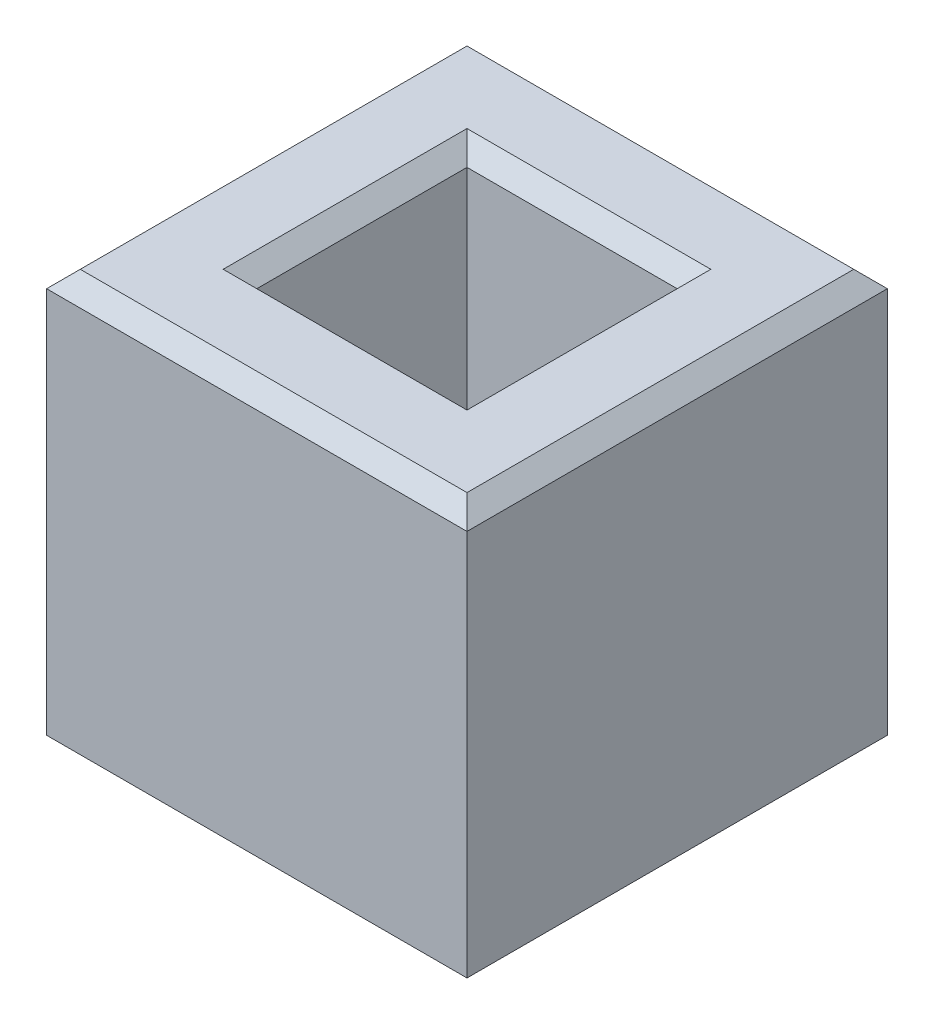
ISO-10303-21;
HEADER;
FILE_DESCRIPTION(('STEP AP214'),'2;1');
FILE_NAME('part.step','',(''),(''),'','','');
FILE_SCHEMA(('AUTOMOTIVE_DESIGN { 1 0 10303 214 1 1 1 1 }'));
ENDSEC;
DATA;
#1=APPLICATION_CONTEXT('core data for automotive mechanical design processes');
#2=APPLICATION_PROTOCOL_DEFINITION('international standard','automotive_design',2000,#1);
#3=PRODUCT_CONTEXT('',#1,'mechanical');
#4=PRODUCT('Part','Part','',(#3));
#5=PRODUCT_RELATED_PRODUCT_CATEGORY('part','',(#4));
#6=PRODUCT_DEFINITION_FORMATION('','',#4);
#7=PRODUCT_DEFINITION_CONTEXT('part definition',#1,'design');
#8=PRODUCT_DEFINITION('design','',#6,#7);
#9=PRODUCT_DEFINITION_SHAPE('','',#8);
#10=(LENGTH_UNIT() NAMED_UNIT(*) SI_UNIT(.MILLI.,.METRE.));
#11=(NAMED_UNIT(*) PLANE_ANGLE_UNIT() SI_UNIT($,.RADIAN.));
#12=(NAMED_UNIT(*) SI_UNIT($,.STERADIAN.) SOLID_ANGLE_UNIT());
#13=UNCERTAINTY_MEASURE_WITH_UNIT(LENGTH_MEASURE(1.E-05),#10,'distance_accuracy_value','');
#14=(GEOMETRIC_REPRESENTATION_CONTEXT(3) GLOBAL_UNCERTAINTY_ASSIGNED_CONTEXT((#13)) GLOBAL_UNIT_ASSIGNED_CONTEXT((#10,
#11,#12)) REPRESENTATION_CONTEXT('',''));
#15=CARTESIAN_POINT('',(0.,0.,0.));
#16=DIRECTION('',(0.,0.,1.));
#17=DIRECTION('',(1.,0.,0.));
#18=AXIS2_PLACEMENT_3D('',#15,#16,#17);
#19=CARTESIAN_POINT('',(63.5,127.,63.5));
#20=DIRECTION('',(-1.,0.,0.));
#21=DIRECTION('',(0.,0.,1.));
#22=AXIS2_PLACEMENT_3D('',#19,#20,#21);
#23=PLANE('',#22);
#24=DIRECTION('',(0.,-1.,0.));
#25=VECTOR('',#24,1.);
#26=CARTESIAN_POINT('',(63.5,127.,63.5));
#27=LINE('',#26,#25);
#28=CARTESIAN_POINT('',(63.5,121.92,63.5));
#29=VERTEX_POINT('',#28);
#30=CARTESIAN_POINT('',(63.5,5.08,63.5));
#31=VERTEX_POINT('',#30);
#32=EDGE_CURVE('E287',#29,#31,#27,.T.);
#33=ORIENTED_EDGE('',*,*,#32,.T.);
#34=DIRECTION('',(0.,0.,-1.));
#35=VECTOR('',#34,1.);
#36=CARTESIAN_POINT('',(63.5,5.08,-63.5));
#37=LINE('',#36,#35);
#38=CARTESIAN_POINT('',(63.5,5.08,-63.5));
#39=VERTEX_POINT('',#38);
#40=EDGE_CURVE('E258',#31,#39,#37,.T.);
#41=ORIENTED_EDGE('',*,*,#40,.T.);
#42=DIRECTION('',(0.,-1.,0.));
#43=VECTOR('',#42,1.);
#44=CARTESIAN_POINT('',(63.5,127.,-63.5));
#45=LINE('',#44,#43);
#46=CARTESIAN_POINT('',(63.5,121.92,-63.5));
#47=VERTEX_POINT('',#46);
#48=EDGE_CURVE('E168',#47,#39,#45,.T.);
#49=ORIENTED_EDGE('',*,*,#48,.F.);
#50=DIRECTION('',(0.,0.,1.));
#51=VECTOR('',#50,1.);
#52=CARTESIAN_POINT('',(63.5,121.92,63.5));
#53=LINE('',#52,#51);
#54=EDGE_CURVE('E260',#47,#29,#53,.T.);
#55=ORIENTED_EDGE('',*,*,#54,.T.);
#56=EDGE_LOOP('',(#33,#41,#49,#55));
#57=FACE_BOUND('',#56,.T.);
#58=ADVANCED_FACE('F33',(#57),#23,.F.);
#59=CARTESIAN_POINT('',(-63.5,127.,-63.5));
#60=DIRECTION('',(0.,0.,1.));
#61=DIRECTION('',(1.,0.,0.));
#62=AXIS2_PLACEMENT_3D('',#59,#60,#61);
#63=PLANE('',#62);
#64=ORIENTED_EDGE('',*,*,#48,.T.);
#65=DIRECTION('',(-1.,0.,0.));
#66=VECTOR('',#65,1.);
#67=CARTESIAN_POINT('',(-63.5,5.08,-63.5));
#68=LINE('',#67,#66);
#69=CARTESIAN_POINT('',(-63.5,5.08,-63.5));
#70=VERTEX_POINT('',#69);
#71=EDGE_CURVE('E167',#39,#70,#68,.T.);
#72=ORIENTED_EDGE('',*,*,#71,.T.);
#73=DIRECTION('',(0.,-1.,0.));
#74=VECTOR('',#73,1.);
#75=CARTESIAN_POINT('',(-63.5,127.,-63.5));
#76=LINE('',#75,#74);
#77=CARTESIAN_POINT('',(-63.5,121.92,-63.5));
#78=VERTEX_POINT('',#77);
#79=EDGE_CURVE('E150',#78,#70,#76,.T.);
#80=ORIENTED_EDGE('',*,*,#79,.F.);
#81=DIRECTION('',(1.,0.,0.));
#82=VECTOR('',#81,1.);
#83=CARTESIAN_POINT('',(-63.5,121.92,-63.5));
#84=LINE('',#83,#82);
#85=EDGE_CURVE('E164',#78,#47,#84,.T.);
#86=ORIENTED_EDGE('',*,*,#85,.T.);
#87=EDGE_LOOP('',(#64,#72,#80,#86));
#88=FACE_BOUND('',#87,.T.);
#89=ADVANCED_FACE('F163',(#88),#63,.F.);
#90=CARTESIAN_POINT('',(-63.5,127.,63.5));
#91=DIRECTION('',(1.,0.,0.));
#92=DIRECTION('',(0.,0.,-1.));
#93=AXIS2_PLACEMENT_3D('',#90,#91,#92);
#94=PLANE('',#93);
#95=ORIENTED_EDGE('',*,*,#79,.T.);
#96=DIRECTION('',(0.,0.,1.));
#97=VECTOR('',#96,1.);
#98=CARTESIAN_POINT('',(-63.5,5.08,63.5));
#99=LINE('',#98,#97);
#100=CARTESIAN_POINT('',(-63.5,5.08,63.5));
#101=VERTEX_POINT('',#100);
#102=EDGE_CURVE('E156',#70,#101,#99,.T.);
#103=ORIENTED_EDGE('',*,*,#102,.T.);
#104=DIRECTION('',(0.,-1.,0.));
#105=VECTOR('',#104,1.);
#106=CARTESIAN_POINT('',(-63.5,127.,63.5));
#107=LINE('',#106,#105);
#108=CARTESIAN_POINT('',(-63.5,121.92,63.5));
#109=VERTEX_POINT('',#108);
#110=EDGE_CURVE('E152',#109,#101,#107,.T.);
#111=ORIENTED_EDGE('',*,*,#110,.F.);
#112=DIRECTION('',(0.,0.,-1.));
#113=VECTOR('',#112,1.);
#114=CARTESIAN_POINT('',(-63.5,121.92,63.5));
#115=LINE('',#114,#113);
#116=EDGE_CURVE('E147',#109,#78,#115,.T.);
#117=ORIENTED_EDGE('',*,*,#116,.T.);
#118=EDGE_LOOP('',(#95,#103,#111,#117));
#119=FACE_BOUND('',#118,.T.);
#120=ADVANCED_FACE('F149',(#119),#94,.F.);
#121=CARTESIAN_POINT('',(-63.5,127.,63.5));
#122=DIRECTION('',(0.,0.,-1.));
#123=DIRECTION('',(-1.,0.,0.));
#124=AXIS2_PLACEMENT_3D('',#121,#122,#123);
#125=PLANE('',#124);
#126=ORIENTED_EDGE('',*,*,#110,.T.);
#127=DIRECTION('',(1.,0.,0.));
#128=VECTOR('',#127,1.);
#129=CARTESIAN_POINT('',(63.5,5.08,63.5));
#130=LINE('',#129,#128);
#131=EDGE_CURVE('E262',#101,#31,#130,.T.);
#132=ORIENTED_EDGE('',*,*,#131,.T.);
#133=ORIENTED_EDGE('',*,*,#32,.F.);
#134=DIRECTION('',(-1.,0.,0.));
#135=VECTOR('',#134,1.);
#136=CARTESIAN_POINT('',(-63.5,121.92,63.5));
#137=LINE('',#136,#135);
#138=EDGE_CURVE('E264',#29,#109,#137,.T.);
#139=ORIENTED_EDGE('',*,*,#138,.T.);
#140=EDGE_LOOP('',(#126,#132,#133,#139));
#141=FACE_BOUND('',#140,.T.);
#142=ADVANCED_FACE('F527',(#141),#125,.F.);
#143=CARTESIAN_POINT('',(0.,127.,0.));
#144=DIRECTION('',(0.,-1.,0.));
#145=DIRECTION('',(0.,0.,-1.));
#146=AXIS2_PLACEMENT_3D('',#143,#144,#145);
#147=PLANE('',#146);
#148=DIRECTION('',(0.,0.,1.));
#149=VECTOR('',#148,1.);
#150=CARTESIAN_POINT('',(-58.42,127.,0.));
#151=LINE('',#150,#149);
#152=CARTESIAN_POINT('',(-58.42,127.,-58.42));
#153=VERTEX_POINT('',#152);
#154=CARTESIAN_POINT('',(-58.42,127.,58.42));
#155=VERTEX_POINT('',#154);
#156=EDGE_CURVE('E42',#153,#155,#151,.T.);
#157=ORIENTED_EDGE('',*,*,#156,.T.);
#158=DIRECTION('',(1.,0.,0.));
#159=VECTOR('',#158,1.);
#160=CARTESIAN_POINT('',(0.,127.,58.42));
#161=LINE('',#160,#159);
#162=CARTESIAN_POINT('',(58.42,127.,58.42));
#163=VERTEX_POINT('',#162);
#164=EDGE_CURVE('E11',#155,#163,#161,.T.);
#165=ORIENTED_EDGE('',*,*,#164,.T.);
#166=DIRECTION('',(0.,0.,-1.));
#167=VECTOR('',#166,1.);
#168=CARTESIAN_POINT('',(58.42,127.,0.));
#169=LINE('',#168,#167);
#170=CARTESIAN_POINT('',(58.42,127.,-58.42));
#171=VERTEX_POINT('',#170);
#172=EDGE_CURVE('E229',#163,#171,#169,.T.);
#173=ORIENTED_EDGE('',*,*,#172,.T.);
#174=DIRECTION('',(-1.,0.,0.));
#175=VECTOR('',#174,1.);
#176=CARTESIAN_POINT('',(0.,127.,-58.42));
#177=LINE('',#176,#175);
#178=EDGE_CURVE('E53',#171,#153,#177,.T.);
#179=ORIENTED_EDGE('',*,*,#178,.T.);
#180=EDGE_LOOP('',(#157,#165,#173,#179));
#181=FACE_BOUND('',#180,.T.);
#182=DIRECTION('',(-1.,0.,0.));
#183=VECTOR('',#182,1.);
#184=CARTESIAN_POINT('',(0.,127.,36.83));
#185=LINE('',#184,#183);
#186=CARTESIAN_POINT('',(36.83,127.,36.83));
#187=VERTEX_POINT('',#186);
#188=CARTESIAN_POINT('',(-36.83,127.,36.83));
#189=VERTEX_POINT('',#188);
#190=EDGE_CURVE('E234',#187,#189,#185,.T.);
#191=ORIENTED_EDGE('',*,*,#190,.T.);
#192=DIRECTION('',(0.,0.,-1.));
#193=VECTOR('',#192,1.);
#194=CARTESIAN_POINT('',(-36.83,127.,0.));
#195=LINE('',#194,#193);
#196=CARTESIAN_POINT('',(-36.83,127.,-36.83));
#197=VERTEX_POINT('',#196);
#198=EDGE_CURVE('E231',#189,#197,#195,.T.);
#199=ORIENTED_EDGE('',*,*,#198,.T.);
#200=DIRECTION('',(1.,0.,0.));
#201=VECTOR('',#200,1.);
#202=CARTESIAN_POINT('',(0.,127.,-36.83));
#203=LINE('',#202,#201);
#204=CARTESIAN_POINT('',(36.83,127.,-36.83));
#205=VERTEX_POINT('',#204);
#206=EDGE_CURVE('E238',#197,#205,#203,.T.);
#207=ORIENTED_EDGE('',*,*,#206,.T.);
#208=DIRECTION('',(0.,0.,1.));
#209=VECTOR('',#208,1.);
#210=CARTESIAN_POINT('',(36.83,127.,0.));
#211=LINE('',#210,#209);
#212=EDGE_CURVE('E236',#205,#187,#211,.T.);
#213=ORIENTED_EDGE('',*,*,#212,.T.);
#214=EDGE_LOOP('',(#191,#199,#207,#213));
#215=FACE_BOUND('',#214,.T.);
#216=ADVANCED_FACE('F518',(#181,#215),#147,.F.);
#217=CARTESIAN_POINT('',(0.,0.,0.));
#218=DIRECTION('',(0.,-1.,0.));
#219=DIRECTION('',(0.,0.,-1.));
#220=AXIS2_PLACEMENT_3D('',#217,#218,#219);
#221=PLANE('',#220);
#222=DIRECTION('',(0.,0.,-1.));
#223=VECTOR('',#222,1.);
#224=CARTESIAN_POINT('',(-58.42,0.,-63.5));
#225=LINE('',#224,#223);
#226=CARTESIAN_POINT('',(-58.42,0.,58.42));
#227=VERTEX_POINT('',#226);
#228=CARTESIAN_POINT('',(-58.42,0.,-58.42));
#229=VERTEX_POINT('',#228);
#230=EDGE_CURVE('E269',#227,#229,#225,.T.);
#231=ORIENTED_EDGE('',*,*,#230,.T.);
#232=DIRECTION('',(1.,0.,0.));
#233=VECTOR('',#232,1.);
#234=CARTESIAN_POINT('',(63.5,0.,-58.42));
#235=LINE('',#234,#233);
#236=CARTESIAN_POINT('',(58.42,0.,-58.42));
#237=VERTEX_POINT('',#236);
#238=EDGE_CURVE('E157',#229,#237,#235,.T.);
#239=ORIENTED_EDGE('',*,*,#238,.T.);
#240=DIRECTION('',(0.,0.,1.));
#241=VECTOR('',#240,1.);
#242=CARTESIAN_POINT('',(58.42,0.,63.5));
#243=LINE('',#242,#241);
#244=CARTESIAN_POINT('',(58.42,0.,58.42));
#245=VERTEX_POINT('',#244);
#246=EDGE_CURVE('E273',#237,#245,#243,.T.);
#247=ORIENTED_EDGE('',*,*,#246,.T.);
#248=DIRECTION('',(-1.,0.,0.));
#249=VECTOR('',#248,1.);
#250=CARTESIAN_POINT('',(-63.5,0.,58.42));
#251=LINE('',#250,#249);
#252=EDGE_CURVE('E271',#245,#227,#251,.T.);
#253=ORIENTED_EDGE('',*,*,#252,.T.);
#254=EDGE_LOOP('',(#231,#239,#247,#253));
#255=FACE_BOUND('',#254,.T.);
#256=DIRECTION('',(0.,0.,1.));
#257=VECTOR('',#256,1.);
#258=CARTESIAN_POINT('',(-36.83,0.,31.75));
#259=LINE('',#258,#257);
#260=CARTESIAN_POINT('',(-36.83,0.,-36.83));
#261=VERTEX_POINT('',#260);
#262=CARTESIAN_POINT('',(-36.83,0.,36.83));
#263=VERTEX_POINT('',#262);
#264=EDGE_CURVE('E278',#261,#263,#259,.T.);
#265=ORIENTED_EDGE('',*,*,#264,.T.);
#266=DIRECTION('',(1.,0.,0.));
#267=VECTOR('',#266,1.);
#268=CARTESIAN_POINT('',(31.75,0.,36.83));
#269=LINE('',#268,#267);
#270=CARTESIAN_POINT('',(36.83,0.,36.83));
#271=VERTEX_POINT('',#270);
#272=EDGE_CURVE('E275',#263,#271,#269,.T.);
#273=ORIENTED_EDGE('',*,*,#272,.T.);
#274=DIRECTION('',(0.,0.,-1.));
#275=VECTOR('',#274,1.);
#276=CARTESIAN_POINT('',(36.83,0.,-31.75));
#277=LINE('',#276,#275);
#278=CARTESIAN_POINT('',(36.83,0.,-36.83));
#279=VERTEX_POINT('',#278);
#280=EDGE_CURVE('E282',#271,#279,#277,.T.);
#281=ORIENTED_EDGE('',*,*,#280,.T.);
#282=DIRECTION('',(-1.,0.,0.));
#283=VECTOR('',#282,1.);
#284=CARTESIAN_POINT('',(-31.75,0.,-36.83));
#285=LINE('',#284,#283);
#286=EDGE_CURVE('E280',#279,#261,#285,.T.);
#287=ORIENTED_EDGE('',*,*,#286,.T.);
#288=EDGE_LOOP('',(#265,#273,#281,#287));
#289=FACE_BOUND('',#288,.T.);
#290=ADVANCED_FACE('F337',(#255,#289),#221,.T.);
#291=CARTESIAN_POINT('',(31.75,0.,31.75));
#292=DIRECTION('',(1.,0.,0.));
#293=DIRECTION('',(0.,0.,-1.));
#294=AXIS2_PLACEMENT_3D('',#291,#292,#293);
#295=PLANE('',#294);
#296=DIRECTION('',(0.,1.,0.));
#297=VECTOR('',#296,1.);
#298=CARTESIAN_POINT('',(31.75,0.,-31.75));
#299=LINE('',#298,#297);
#300=CARTESIAN_POINT('',(31.75,5.08000000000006,-31.75));
#301=VERTEX_POINT('',#300);
#302=CARTESIAN_POINT('',(31.75,121.92,-31.75));
#303=VERTEX_POINT('',#302);
#304=EDGE_CURVE('E220',#301,#303,#299,.T.);
#305=ORIENTED_EDGE('',*,*,#304,.F.);
#306=DIRECTION('',(0.,0.,1.));
#307=VECTOR('',#306,1.);
#308=CARTESIAN_POINT('',(31.75,5.08000000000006,31.75));
#309=LINE('',#308,#307);
#310=CARTESIAN_POINT('',(31.75,5.08000000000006,31.75));
#311=VERTEX_POINT('',#310);
#312=EDGE_CURVE('E240',#301,#311,#309,.T.);
#313=ORIENTED_EDGE('',*,*,#312,.T.);
#314=DIRECTION('',(0.,1.,0.));
#315=VECTOR('',#314,1.);
#316=CARTESIAN_POINT('',(31.75,0.,31.75));
#317=LINE('',#316,#315);
#318=CARTESIAN_POINT('',(31.75,121.92,31.75));
#319=VERTEX_POINT('',#318);
#320=EDGE_CURVE('E290',#311,#319,#317,.T.);
#321=ORIENTED_EDGE('',*,*,#320,.T.);
#322=DIRECTION('',(0.,0.,-1.));
#323=VECTOR('',#322,1.);
#324=CARTESIAN_POINT('',(31.75,121.92,31.75));
#325=LINE('',#324,#323);
#326=EDGE_CURVE('E242',#319,#303,#325,.T.);
#327=ORIENTED_EDGE('',*,*,#326,.T.);
#328=EDGE_LOOP('',(#305,#313,#321,#327));
#329=FACE_BOUND('',#328,.T.);
#330=ADVANCED_FACE('F304',(#329),#295,.F.);
#331=CARTESIAN_POINT('',(-31.75,0.,31.75));
#332=DIRECTION('',(0.,0.,1.));
#333=DIRECTION('',(1.,0.,0.));
#334=AXIS2_PLACEMENT_3D('',#331,#332,#333);
#335=PLANE('',#334);
#336=ORIENTED_EDGE('',*,*,#320,.F.);
#337=DIRECTION('',(-1.,0.,0.));
#338=VECTOR('',#337,1.);
#339=CARTESIAN_POINT('',(-31.75,5.08000000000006,31.75));
#340=LINE('',#339,#338);
#341=CARTESIAN_POINT('',(-31.75,5.08000000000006,31.75));
#342=VERTEX_POINT('',#341);
#343=EDGE_CURVE('E253',#311,#342,#340,.T.);
#344=ORIENTED_EDGE('',*,*,#343,.T.);
#345=DIRECTION('',(0.,1.,0.));
#346=VECTOR('',#345,1.);
#347=CARTESIAN_POINT('',(-31.75,0.,31.75));
#348=LINE('',#347,#346);
#349=CARTESIAN_POINT('',(-31.75,121.92,31.75));
#350=VERTEX_POINT('',#349);
#351=EDGE_CURVE('E296',#342,#350,#348,.T.);
#352=ORIENTED_EDGE('',*,*,#351,.T.);
#353=DIRECTION('',(1.,0.,0.));
#354=VECTOR('',#353,1.);
#355=CARTESIAN_POINT('',(-31.75,121.92,31.75));
#356=LINE('',#355,#354);
#357=EDGE_CURVE('E256',#350,#319,#356,.T.);
#358=ORIENTED_EDGE('',*,*,#357,.T.);
#359=EDGE_LOOP('',(#336,#344,#352,#358));
#360=FACE_BOUND('',#359,.T.);
#361=ADVANCED_FACE('F327',(#360),#335,.F.);
#362=CARTESIAN_POINT('',(-31.75,0.,31.75));
#363=DIRECTION('',(-1.,0.,0.));
#364=DIRECTION('',(0.,0.,1.));
#365=AXIS2_PLACEMENT_3D('',#362,#363,#364);
#366=PLANE('',#365);
#367=ORIENTED_EDGE('',*,*,#351,.F.);
#368=DIRECTION('',(0.,0.,-1.));
#369=VECTOR('',#368,1.);
#370=CARTESIAN_POINT('',(-31.75,5.08000000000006,-31.75));
#371=LINE('',#370,#369);
#372=CARTESIAN_POINT('',(-31.75,5.08000000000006,-31.75));
#373=VERTEX_POINT('',#372);
#374=EDGE_CURVE('E248',#342,#373,#371,.T.);
#375=ORIENTED_EDGE('',*,*,#374,.T.);
#376=DIRECTION('',(0.,1.,0.));
#377=VECTOR('',#376,1.);
#378=CARTESIAN_POINT('',(-31.75,0.,-31.75));
#379=LINE('',#378,#377);
#380=CARTESIAN_POINT('',(-31.75,121.92,-31.75));
#381=VERTEX_POINT('',#380);
#382=EDGE_CURVE('E293',#373,#381,#379,.T.);
#383=ORIENTED_EDGE('',*,*,#382,.T.);
#384=DIRECTION('',(0.,0.,1.));
#385=VECTOR('',#384,1.);
#386=CARTESIAN_POINT('',(-31.75,121.92,31.75));
#387=LINE('',#386,#385);
#388=EDGE_CURVE('E250',#381,#350,#387,.T.);
#389=ORIENTED_EDGE('',*,*,#388,.T.);
#390=EDGE_LOOP('',(#367,#375,#383,#389));
#391=FACE_BOUND('',#390,.T.);
#392=ADVANCED_FACE('F319',(#391),#366,.F.);
#393=CARTESIAN_POINT('',(-31.75,0.,-31.75));
#394=DIRECTION('',(0.,0.,-1.));
#395=DIRECTION('',(-1.,0.,0.));
#396=AXIS2_PLACEMENT_3D('',#393,#394,#395);
#397=PLANE('',#396);
#398=ORIENTED_EDGE('',*,*,#382,.F.);
#399=DIRECTION('',(1.,0.,0.));
#400=VECTOR('',#399,1.);
#401=CARTESIAN_POINT('',(31.75,5.08000000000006,-31.75));
#402=LINE('',#401,#400);
#403=EDGE_CURVE('E244',#373,#301,#402,.T.);
#404=ORIENTED_EDGE('',*,*,#403,.T.);
#405=ORIENTED_EDGE('',*,*,#304,.T.);
#406=DIRECTION('',(-1.,0.,0.));
#407=VECTOR('',#406,1.);
#408=CARTESIAN_POINT('',(-31.75,121.92,-31.75));
#409=LINE('',#408,#407);
#410=EDGE_CURVE('E246',#303,#381,#409,.T.);
#411=ORIENTED_EDGE('',*,*,#410,.T.);
#412=EDGE_LOOP('',(#398,#404,#405,#411));
#413=FACE_BOUND('',#412,.T.);
#414=ADVANCED_FACE('F315',(#413),#397,.F.);
#415=CARTESIAN_POINT('',(-63.5,5.08,63.5));
#416=DIRECTION('',(0.,-0.70710678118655,0.707106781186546));
#417=DIRECTION('',(-1.,0.,0.));
#418=AXIS2_PLACEMENT_3D('',#415,#416,#417);
#419=PLANE('',#418);
#420=DIRECTION('',(0.577350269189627,-0.577350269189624,-0.577350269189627));
#421=VECTOR('',#420,1.);
#422=CARTESIAN_POINT('',(-63.5,5.08,63.5));
#423=LINE('',#422,#421);
#424=EDGE_CURVE('E221',#227,#101,#423,.F.);
#425=ORIENTED_EDGE('',*,*,#424,.F.);
#426=ORIENTED_EDGE('',*,*,#252,.F.);
#427=DIRECTION('',(-0.577350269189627,-0.577350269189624,-0.577350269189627));
#428=VECTOR('',#427,1.);
#429=CARTESIAN_POINT('',(63.5,5.08,63.5));
#430=LINE('',#429,#428);
#431=EDGE_CURVE('E217',#31,#245,#430,.T.);
#432=ORIENTED_EDGE('',*,*,#431,.F.);
#433=ORIENTED_EDGE('',*,*,#131,.F.);
#434=EDGE_LOOP('',(#425,#426,#432,#433));
#435=FACE_BOUND('',#434,.T.);
#436=ADVANCED_FACE('F367',(#435),#419,.T.);
#437=CARTESIAN_POINT('',(63.5,5.08,63.5));
#438=DIRECTION('',(0.707106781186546,-0.70710678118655,0.));
#439=DIRECTION('',(0.,0.,1.));
#440=AXIS2_PLACEMENT_3D('',#437,#438,#439);
#441=PLANE('',#440);
#442=ORIENTED_EDGE('',*,*,#431,.T.);
#443=ORIENTED_EDGE('',*,*,#246,.F.);
#444=DIRECTION('',(0.577350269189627,0.577350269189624,-0.577350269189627));
#445=VECTOR('',#444,1.);
#446=CARTESIAN_POINT('',(21.1666666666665,-37.2533333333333,-21.1666666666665));
#447=LINE('',#446,#445);
#448=EDGE_CURVE('E224',#39,#237,#447,.F.);
#449=ORIENTED_EDGE('',*,*,#448,.F.);
#450=ORIENTED_EDGE('',*,*,#40,.F.);
#451=EDGE_LOOP('',(#442,#443,#449,#450));
#452=FACE_BOUND('',#451,.T.);
#453=ADVANCED_FACE('F363',(#452),#441,.T.);
#454=CARTESIAN_POINT('',(-63.5,5.08,63.5));
#455=DIRECTION('',(-0.707106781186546,-0.70710678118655,0.));
#456=DIRECTION('',(0.,0.,-1.));
#457=AXIS2_PLACEMENT_3D('',#454,#455,#456);
#458=PLANE('',#457);
#459=ORIENTED_EDGE('',*,*,#424,.T.);
#460=ORIENTED_EDGE('',*,*,#102,.F.);
#461=DIRECTION('',(0.577350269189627,-0.577350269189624,0.577350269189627));
#462=VECTOR('',#461,1.);
#463=CARTESIAN_POINT('',(-21.1666666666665,-37.2533333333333,-21.1666666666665));
#464=LINE('',#463,#462);
#465=EDGE_CURVE('E212',#229,#70,#464,.F.);
#466=ORIENTED_EDGE('',*,*,#465,.F.);
#467=ORIENTED_EDGE('',*,*,#230,.F.);
#468=EDGE_LOOP('',(#459,#460,#466,#467));
#469=FACE_BOUND('',#468,.T.);
#470=ADVANCED_FACE('F348',(#469),#458,.T.);
#471=CARTESIAN_POINT('',(-63.5,5.08,-63.5));
#472=DIRECTION('',(0.,-0.70710678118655,-0.707106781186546));
#473=DIRECTION('',(1.,0.,0.));
#474=AXIS2_PLACEMENT_3D('',#471,#472,#473);
#475=PLANE('',#474);
#476=ORIENTED_EDGE('',*,*,#448,.T.);
#477=ORIENTED_EDGE('',*,*,#238,.F.);
#478=ORIENTED_EDGE('',*,*,#465,.T.);
#479=ORIENTED_EDGE('',*,*,#71,.F.);
#480=EDGE_LOOP('',(#476,#477,#478,#479));
#481=FACE_BOUND('',#480,.T.);
#482=ADVANCED_FACE('F341',(#481),#475,.T.);
#483=CARTESIAN_POINT('',(0.,0.,-36.83));
#484=DIRECTION('',(0.,-0.707106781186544,0.707106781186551));
#485=DIRECTION('',(1.,0.,0.));
#486=AXIS2_PLACEMENT_3D('',#483,#484,#485);
#487=PLANE('',#486);
#488=DIRECTION('',(0.577350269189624,-0.57735026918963,-0.577350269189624));
#489=VECTOR('',#488,1.);
#490=CARTESIAN_POINT('',(24.5533333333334,12.2766666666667,-24.5533333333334));
#491=LINE('',#490,#489);
#492=EDGE_CURVE('E213',#301,#279,#491,.T.);
#493=ORIENTED_EDGE('',*,*,#492,.F.);
#494=ORIENTED_EDGE('',*,*,#403,.F.);
#495=DIRECTION('',(-0.577350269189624,-0.57735026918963,-0.577350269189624));
#496=VECTOR('',#495,1.);
#497=CARTESIAN_POINT('',(-24.5533333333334,12.2766666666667,-24.5533333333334));
#498=LINE('',#497,#496);
#499=EDGE_CURVE('E209',#261,#373,#498,.F.);
#500=ORIENTED_EDGE('',*,*,#499,.F.);
#501=ORIENTED_EDGE('',*,*,#286,.F.);
#502=EDGE_LOOP('',(#493,#494,#500,#501));
#503=FACE_BOUND('',#502,.T.);
#504=ADVANCED_FACE('F339',(#503),#487,.T.);
#505=CARTESIAN_POINT('',(-36.83,0.,0.));
#506=DIRECTION('',(0.707106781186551,-0.707106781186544,0.));
#507=DIRECTION('',(0.,0.,-1.));
#508=AXIS2_PLACEMENT_3D('',#505,#506,#507);
#509=PLANE('',#508);
#510=ORIENTED_EDGE('',*,*,#499,.T.);
#511=ORIENTED_EDGE('',*,*,#374,.F.);
#512=DIRECTION('',(-0.577350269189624,-0.57735026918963,0.577350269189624));
#513=VECTOR('',#512,1.);
#514=CARTESIAN_POINT('',(-24.5533333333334,12.2766666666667,24.5533333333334));
#515=LINE('',#514,#513);
#516=EDGE_CURVE('E181',#263,#342,#515,.F.);
#517=ORIENTED_EDGE('',*,*,#516,.F.);
#518=ORIENTED_EDGE('',*,*,#264,.F.);
#519=EDGE_LOOP('',(#510,#511,#517,#518));
#520=FACE_BOUND('',#519,.T.);
#521=ADVANCED_FACE('F323',(#520),#509,.T.);
#522=CARTESIAN_POINT('',(36.83,0.,0.));
#523=DIRECTION('',(-0.707106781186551,-0.707106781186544,0.));
#524=DIRECTION('',(0.,0.,1.));
#525=AXIS2_PLACEMENT_3D('',#522,#523,#524);
#526=PLANE('',#525);
#527=ORIENTED_EDGE('',*,*,#492,.T.);
#528=ORIENTED_EDGE('',*,*,#280,.F.);
#529=DIRECTION('',(-0.577350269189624,0.57735026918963,-0.577350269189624));
#530=VECTOR('',#529,1.);
#531=CARTESIAN_POINT('',(24.5533333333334,12.2766666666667,24.5533333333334));
#532=LINE('',#531,#530);
#533=EDGE_CURVE('E179',#311,#271,#532,.F.);
#534=ORIENTED_EDGE('',*,*,#533,.F.);
#535=ORIENTED_EDGE('',*,*,#312,.F.);
#536=EDGE_LOOP('',(#527,#528,#534,#535));
#537=FACE_BOUND('',#536,.T.);
#538=ADVANCED_FACE('F333',(#537),#526,.T.);
#539=CARTESIAN_POINT('',(0.,0.,36.83));
#540=DIRECTION('',(0.,-0.707106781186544,-0.707106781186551));
#541=DIRECTION('',(-1.,0.,0.));
#542=AXIS2_PLACEMENT_3D('',#539,#540,#541);
#543=PLANE('',#542);
#544=ORIENTED_EDGE('',*,*,#516,.T.);
#545=ORIENTED_EDGE('',*,*,#343,.F.);
#546=ORIENTED_EDGE('',*,*,#533,.T.);
#547=ORIENTED_EDGE('',*,*,#272,.F.);
#548=EDGE_LOOP('',(#544,#545,#546,#547));
#549=FACE_BOUND('',#548,.T.);
#550=ADVANCED_FACE('F330',(#549),#543,.T.);
#551=CARTESIAN_POINT('',(0.,127.,-58.42));
#552=DIRECTION('',(0.,-0.707106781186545,0.707106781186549));
#553=DIRECTION('',(-1.,0.,0.));
#554=AXIS2_PLACEMENT_3D('',#551,#552,#553);
#555=PLANE('',#554);
#556=DIRECTION('',(-0.577350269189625,0.577350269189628,0.577350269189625));
#557=VECTOR('',#556,1.);
#558=CARTESIAN_POINT('',(38.9466666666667,146.473333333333,-38.9466666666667));
#559=LINE('',#558,#557);
#560=EDGE_CURVE('E175',#47,#171,#559,.T.);
#561=ORIENTED_EDGE('',*,*,#560,.F.);
#562=ORIENTED_EDGE('',*,*,#85,.F.);
#563=DIRECTION('',(0.577350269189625,0.577350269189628,0.577350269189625));
#564=VECTOR('',#563,1.);
#565=CARTESIAN_POINT('',(-38.9466666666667,146.473333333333,-38.9466666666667));
#566=LINE('',#565,#564);
#567=EDGE_CURVE('E173',#153,#78,#566,.F.);
#568=ORIENTED_EDGE('',*,*,#567,.F.);
#569=ORIENTED_EDGE('',*,*,#178,.F.);
#570=EDGE_LOOP('',(#561,#562,#568,#569));
#571=FACE_BOUND('',#570,.T.);
#572=ADVANCED_FACE('F172',(#571),#555,.F.);
#573=CARTESIAN_POINT('',(-58.42,127.,0.));
#574=DIRECTION('',(0.707106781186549,-0.707106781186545,0.));
#575=DIRECTION('',(0.,0.,1.));
#576=AXIS2_PLACEMENT_3D('',#573,#574,#575);
#577=PLANE('',#576);
#578=ORIENTED_EDGE('',*,*,#567,.T.);
#579=ORIENTED_EDGE('',*,*,#116,.F.);
#580=DIRECTION('',(0.577350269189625,0.577350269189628,-0.577350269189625));
#581=VECTOR('',#580,1.);
#582=CARTESIAN_POINT('',(-38.9466666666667,146.473333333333,38.9466666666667));
#583=LINE('',#582,#581);
#584=EDGE_CURVE('E183',#155,#109,#583,.F.);
#585=ORIENTED_EDGE('',*,*,#584,.F.);
#586=ORIENTED_EDGE('',*,*,#156,.F.);
#587=EDGE_LOOP('',(#578,#579,#585,#586));
#588=FACE_BOUND('',#587,.T.);
#589=ADVANCED_FACE('F178',(#588),#577,.F.);
#590=CARTESIAN_POINT('',(58.42,127.,0.));
#591=DIRECTION('',(-0.707106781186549,-0.707106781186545,0.));
#592=DIRECTION('',(0.,0.,-1.));
#593=AXIS2_PLACEMENT_3D('',#590,#591,#592);
#594=PLANE('',#593);
#595=ORIENTED_EDGE('',*,*,#560,.T.);
#596=ORIENTED_EDGE('',*,*,#172,.F.);
#597=DIRECTION('',(0.577350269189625,-0.577350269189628,0.577350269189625));
#598=VECTOR('',#597,1.);
#599=CARTESIAN_POINT('',(38.9466666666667,146.473333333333,38.9466666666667));
#600=LINE('',#599,#598);
#601=EDGE_CURVE('E197',#29,#163,#600,.F.);
#602=ORIENTED_EDGE('',*,*,#601,.F.);
#603=ORIENTED_EDGE('',*,*,#54,.F.);
#604=EDGE_LOOP('',(#595,#596,#602,#603));
#605=FACE_BOUND('',#604,.T.);
#606=ADVANCED_FACE('F395',(#605),#594,.F.);
#607=CARTESIAN_POINT('',(0.,127.,58.42));
#608=DIRECTION('',(0.,-0.707106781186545,-0.707106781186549));
#609=DIRECTION('',(1.,0.,0.));
#610=AXIS2_PLACEMENT_3D('',#607,#608,#609);
#611=PLANE('',#610);
#612=ORIENTED_EDGE('',*,*,#584,.T.);
#613=ORIENTED_EDGE('',*,*,#138,.F.);
#614=ORIENTED_EDGE('',*,*,#601,.T.);
#615=ORIENTED_EDGE('',*,*,#164,.F.);
#616=EDGE_LOOP('',(#612,#613,#614,#615));
#617=FACE_BOUND('',#616,.T.);
#618=ADVANCED_FACE('F402',(#617),#611,.F.);
#619=CARTESIAN_POINT('',(31.75,121.92,31.75));
#620=DIRECTION('',(0.707106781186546,-0.70710678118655,0.));
#621=DIRECTION('',(0.,0.,-1.));
#622=AXIS2_PLACEMENT_3D('',#619,#620,#621);
#623=PLANE('',#622);
#624=DIRECTION('',(0.577350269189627,0.577350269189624,0.577350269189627));
#625=VECTOR('',#624,1.);
#626=CARTESIAN_POINT('',(10.5833333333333,100.753333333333,10.5833333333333));
#627=LINE('',#626,#625);
#628=EDGE_CURVE('E190',#187,#319,#627,.F.);
#629=ORIENTED_EDGE('',*,*,#628,.F.);
#630=ORIENTED_EDGE('',*,*,#212,.F.);
#631=DIRECTION('',(0.577350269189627,0.577350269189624,-0.577350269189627));
#632=VECTOR('',#631,1.);
#633=CARTESIAN_POINT('',(10.5833333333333,100.753333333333,-10.5833333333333));
#634=LINE('',#633,#632);
#635=EDGE_CURVE('E37',#303,#205,#634,.T.);
#636=ORIENTED_EDGE('',*,*,#635,.F.);
#637=ORIENTED_EDGE('',*,*,#326,.F.);
#638=EDGE_LOOP('',(#629,#630,#636,#637));
#639=FACE_BOUND('',#638,.T.);
#640=ADVANCED_FACE('F35',(#639),#623,.F.);
#641=CARTESIAN_POINT('',(-31.75,121.92,-31.75));
#642=DIRECTION('',(0.,-0.70710678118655,-0.707106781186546));
#643=DIRECTION('',(-1.,0.,0.));
#644=AXIS2_PLACEMENT_3D('',#641,#642,#643);
#645=PLANE('',#644);
#646=ORIENTED_EDGE('',*,*,#635,.T.);
#647=ORIENTED_EDGE('',*,*,#206,.F.);
#648=DIRECTION('',(0.577350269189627,-0.577350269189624,0.577350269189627));
#649=VECTOR('',#648,1.);
#650=CARTESIAN_POINT('',(-10.5833333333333,100.753333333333,-10.5833333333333));
#651=LINE('',#650,#649);
#652=EDGE_CURVE('E189',#381,#197,#651,.F.);
#653=ORIENTED_EDGE('',*,*,#652,.F.);
#654=ORIENTED_EDGE('',*,*,#410,.F.);
#655=EDGE_LOOP('',(#646,#647,#653,#654));
#656=FACE_BOUND('',#655,.T.);
#657=ADVANCED_FACE('F311',(#656),#645,.F.);
#658=CARTESIAN_POINT('',(-31.75,121.92,31.75));
#659=DIRECTION('',(0.,-0.70710678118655,0.707106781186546));
#660=DIRECTION('',(1.,0.,0.));
#661=AXIS2_PLACEMENT_3D('',#658,#659,#660);
#662=PLANE('',#661);
#663=ORIENTED_EDGE('',*,*,#628,.T.);
#664=ORIENTED_EDGE('',*,*,#357,.F.);
#665=DIRECTION('',(-0.577350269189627,0.577350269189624,0.577350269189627));
#666=VECTOR('',#665,1.);
#667=CARTESIAN_POINT('',(-31.75,121.92,31.75));
#668=LINE('',#667,#666);
#669=EDGE_CURVE('E187',#189,#350,#668,.F.);
#670=ORIENTED_EDGE('',*,*,#669,.F.);
#671=ORIENTED_EDGE('',*,*,#190,.F.);
#672=EDGE_LOOP('',(#663,#664,#670,#671));
#673=FACE_BOUND('',#672,.T.);
#674=ADVANCED_FACE('F420',(#673),#662,.F.);
#675=CARTESIAN_POINT('',(-31.75,121.92,31.75));
#676=DIRECTION('',(-0.707106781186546,-0.70710678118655,0.));
#677=DIRECTION('',(0.,0.,1.));
#678=AXIS2_PLACEMENT_3D('',#675,#676,#677);
#679=PLANE('',#678);
#680=ORIENTED_EDGE('',*,*,#652,.T.);
#681=ORIENTED_EDGE('',*,*,#198,.F.);
#682=ORIENTED_EDGE('',*,*,#669,.T.);
#683=ORIENTED_EDGE('',*,*,#388,.F.);
#684=EDGE_LOOP('',(#680,#681,#682,#683));
#685=FACE_BOUND('',#684,.T.);
#686=ADVANCED_FACE('F426',(#685),#679,.F.);
#687=CLOSED_SHELL('',(#58,#89,#120,#142,#216,#290,#330,#361,#392,#414,#436,#453,#470,#482,#504,
#521,#538,#550,#572,#589,#606,#618,#640,#657,#674,#686));
#688=MANIFOLD_SOLID_BREP('B2',#687);
#689=ADVANCED_BREP_SHAPE_REPRESENTATION('',(#18,#688),#14);
#690=SHAPE_DEFINITION_REPRESENTATION(#9,#689);
ENDSEC;
END-ISO-10303-21;
